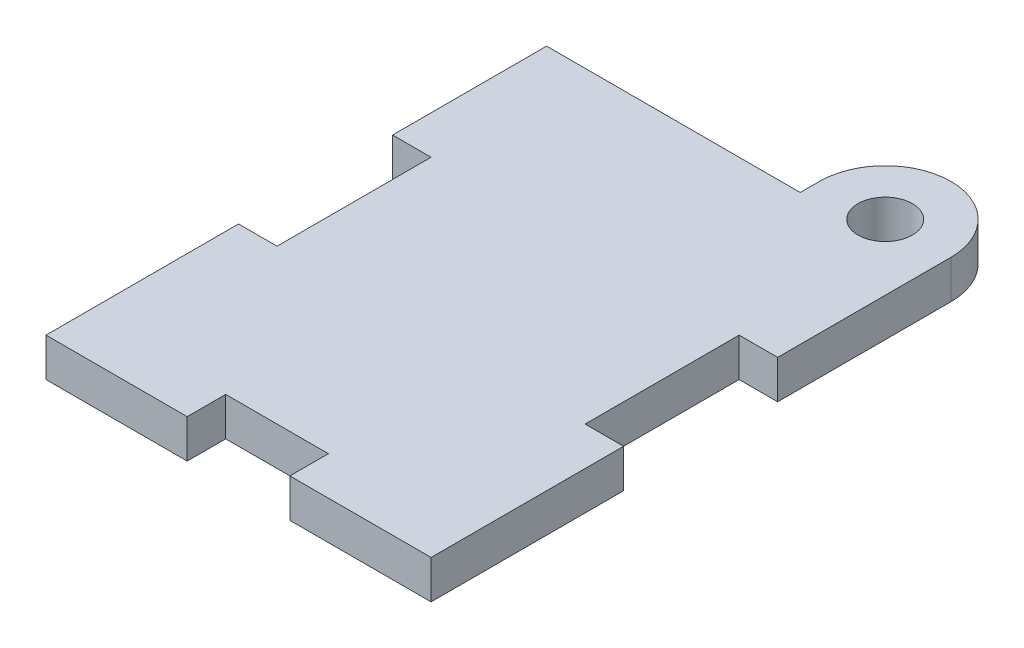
from build123d import *

# Parameters (mm, degrees)
SKETCH1_R           = 2.24506403
BOSS_EXTRUDE1_DEPTH = 3.175


with BuildPart() as part:
    # Sketch1 → Boss-Extrude1 (new body)
    with BuildSketch(Plane(origin=(0, 0, 0), x_dir=(1, 0, 0), z_dir=(0, 1, 0))):
        with BuildLine():
            Line((-15.875, 38.1), (5.034871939, 38.1))
            Line((5.034871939, 38.1), (5.034871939, 39.6875))
            ThreePointArc((5.034871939, 39.6875), (10.45493597, 45.10756403), (15.875, 39.6875))
            Line((15.875, 39.6875), (15.875, 25.4))
            Line((15.875, 25.4), (12.7, 25.4))
            Line((12.7, 25.4), (12.7, 12.7))
            Line((12.7, 12.7), (15.875, 12.7))
            Line((15.875, 12.7), (15.875, -3.175))
            Line((15.875, -3.175), (4.233333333, -3.175))
            Line((4.233333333, -3.175), (4.233333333, 0))
            Line((4.233333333, 0), (-4.233333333, 0))
            Line((-4.233333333, 0), (-4.233333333, -3.175))
            Line((-4.233333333, -3.175), (-15.875, -3.175))
            Line((-15.875, -3.175), (-15.875, 12.7))
            Line((-15.875, 12.7), (-12.7, 12.7))
            Line((-12.7, 12.7), (-12.7, 25.4))
            Line((-12.7, 25.4), (-15.875, 25.4))
            Line((-15.875, 25.4), (-15.875, 38.1))
        make_face()
        with Locations(Location((10.45493597, 39.6875, 0), (0, 0, 270))):
            Circle(SKETCH1_R, mode=Mode.SUBTRACT)
    extrude(amount=BOSS_EXTRUDE1_DEPTH)


solid = part.part
